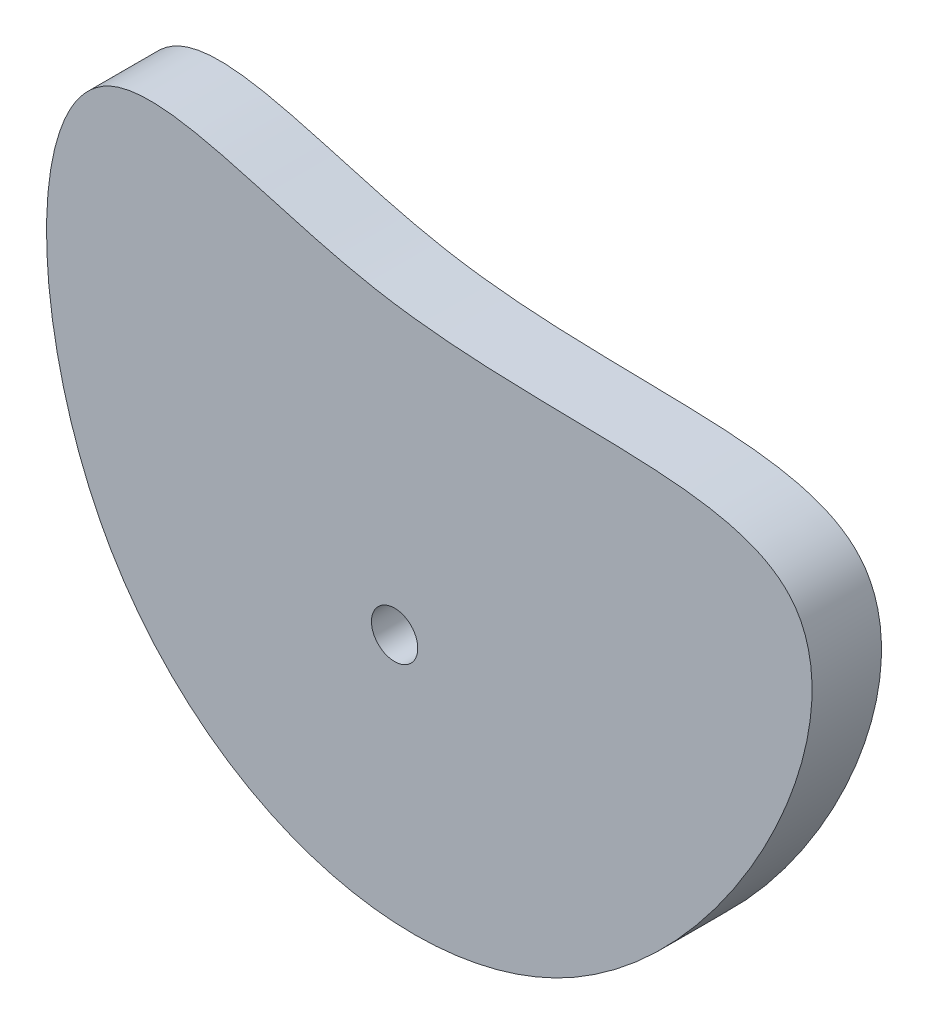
from build123d import *

# Parameters (mm, degrees)
SKETCH1_R      = 31.75
SKETCH1_R_2    = 6.35
EXTRUDE1_DEPTH = 19.05
EXTRUDE2_START = -19.05
SKETCH2_R      = 6.35
EXTRUDE2_DEPTH = 19.05


with BuildPart() as part:
    # Sketch1 → Extrude1 (new body)
    with BuildSketch(Plane.XY):
        with Locations(Location((0, 0, 0), (0, 0, 180))):
            Circle(SKETCH1_R)
        with Locations(Location((0, 0, 0), (0, 0, 180))):
            Circle(SKETCH1_R_2, mode=Mode.SUBTRACT)
    extrude(amount=EXTRUDE1_DEPTH)

    # Sketch2 → Extrude2 (add)
    with BuildSketch(Plane.XY.offset(19.05).offset(EXTRUDE2_START)):
        with BuildLine():
            add(Edge.make_bspline(
                [(-5.305562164, 79.543651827), (41.947300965, 70.861010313), (156.311517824, 96.680501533), (59.556806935, -101.223747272), (-98.512001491, -48.982678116), (-102.523033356, 118.98811205), (-35.44537841, 85.081797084), (-5.305562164, 79.543651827)],
                knots=[0, 0, 0, 0, 0.206404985, 0.442174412, 0.680558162, 0.868346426, 1, 1, 1, 1], degree=3))
        make_face()
        with Locations(Location((0, 0, 0), (0, 0, 180))):
            Circle(SKETCH2_R, mode=Mode.SUBTRACT)
    extrude(amount=EXTRUDE2_DEPTH)


solid = part.part
